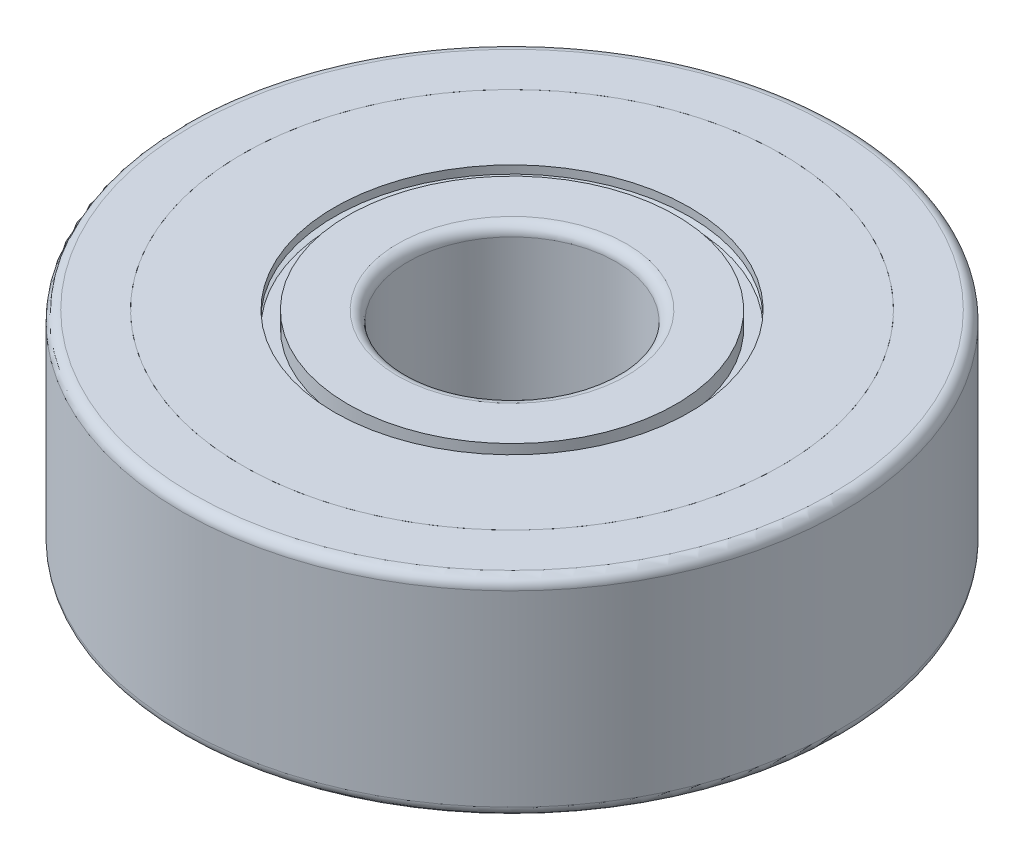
ISO-10303-21;
HEADER;
FILE_DESCRIPTION(('STEP AP214'),'2;1');
FILE_NAME('part.step','',(''),(''),'','','');
FILE_SCHEMA(('AUTOMOTIVE_DESIGN { 1 0 10303 214 1 1 1 1 }'));
ENDSEC;
DATA;
#1=APPLICATION_CONTEXT('core data for automotive mechanical design processes');
#2=APPLICATION_PROTOCOL_DEFINITION('international standard','automotive_design',2000,#1);
#3=PRODUCT_CONTEXT('',#1,'mechanical');
#4=PRODUCT('Part','Part','',(#3));
#5=PRODUCT_RELATED_PRODUCT_CATEGORY('part','',(#4));
#6=PRODUCT_DEFINITION_FORMATION('','',#4);
#7=PRODUCT_DEFINITION_CONTEXT('part definition',#1,'design');
#8=PRODUCT_DEFINITION('design','',#6,#7);
#9=PRODUCT_DEFINITION_SHAPE('','',#8);
#10=(LENGTH_UNIT() NAMED_UNIT(*) SI_UNIT(.MILLI.,.METRE.));
#11=(NAMED_UNIT(*) PLANE_ANGLE_UNIT() SI_UNIT($,.RADIAN.));
#12=(NAMED_UNIT(*) SI_UNIT($,.STERADIAN.) SOLID_ANGLE_UNIT());
#13=UNCERTAINTY_MEASURE_WITH_UNIT(LENGTH_MEASURE(1.E-05),#10,'distance_accuracy_value','');
#14=(GEOMETRIC_REPRESENTATION_CONTEXT(3) GLOBAL_UNCERTAINTY_ASSIGNED_CONTEXT((#13)) GLOBAL_UNIT_ASSIGNED_CONTEXT((#10,
#11,#12)) REPRESENTATION_CONTEXT('',''));
#15=CARTESIAN_POINT('',(0.,0.,0.));
#16=DIRECTION('',(0.,0.,1.));
#17=DIRECTION('',(1.,0.,0.));
#18=AXIS2_PLACEMENT_3D('',#15,#16,#17);
#19=CARTESIAN_POINT('',(0.,3.,0.));
#20=DIRECTION('',(0.,1.,0.));
#21=DIRECTION('',(0.,0.,-1.));
#22=AXIS2_PLACEMENT_3D('',#19,#20,#21);
#23=TOROIDAL_SURFACE('',#22,6.25,1.95);
#24=ADVANCED_FACE('P0_F14',(),#23,.T.);
#25=CLOSED_SHELL('',(#24));
#26=MANIFOLD_SOLID_BREP('P0_B1',#25);
#27=CARTESIAN_POINT('',(0.,6.,0.));
#28=DIRECTION('',(0.,-1.,0.));
#29=DIRECTION('',(0.,0.,-1.));
#30=AXIS2_PLACEMENT_3D('',#27,#28,#29);
#31=CYLINDRICAL_SURFACE('',#30,3.);
#32=CARTESIAN_POINT('',(0.,5.7,0.));
#33=DIRECTION('',(0.,1.,0.));
#34=DIRECTION('',(0.,0.,-1.));
#35=AXIS2_PLACEMENT_3D('',#32,#33,#34);
#36=CIRCLE('',#35,3.);
#37=CARTESIAN_POINT('',(0.,5.7,-3.));
#38=VERTEX_POINT('',#37);
#39=EDGE_CURVE('P1_E81',#38,#38,#36,.F.);
#40=ORIENTED_EDGE('',*,*,#39,.F.);
#41=EDGE_LOOP('',(#40));
#42=FACE_BOUND('',#41,.T.);
#43=CARTESIAN_POINT('',(0.,0.3,0.));
#44=DIRECTION('',(0.,-1.,0.));
#45=DIRECTION('',(0.,0.,1.));
#46=AXIS2_PLACEMENT_3D('',#43,#44,#45);
#47=CIRCLE('',#46,3.);
#48=CARTESIAN_POINT('',(0.,0.3,3.));
#49=VERTEX_POINT('',#48);
#50=EDGE_CURVE('P1_E77',#49,#49,#47,.F.);
#51=ORIENTED_EDGE('',*,*,#50,.F.);
#52=EDGE_LOOP('',(#51));
#53=FACE_BOUND('',#52,.T.);
#54=ADVANCED_FACE('P1_F15',(#42,#53),#31,.F.);
#55=CARTESIAN_POINT('',(0.,5.7,0.));
#56=DIRECTION('',(0.,1.,0.));
#57=DIRECTION('',(0.,0.,-1.));
#58=AXIS2_PLACEMENT_3D('',#55,#56,#57);
#59=TOROIDAL_SURFACE('',#58,3.3,0.3);
#60=CARTESIAN_POINT('',(0.,6.,0.));
#61=DIRECTION('',(0.,1.,0.));
#62=DIRECTION('',(0.,0.,1.));
#63=AXIS2_PLACEMENT_3D('',#60,#61,#62);
#64=CIRCLE('',#63,3.3);
#65=CARTESIAN_POINT('',(0.,6.,3.3));
#66=VERTEX_POINT('',#65);
#67=EDGE_CURVE('P1_E80',#66,#66,#64,.F.);
#68=ORIENTED_EDGE('',*,*,#67,.F.);
#69=EDGE_LOOP('',(#68));
#70=FACE_BOUND('',#69,.T.);
#71=ORIENTED_EDGE('',*,*,#39,.T.);
#72=EDGE_LOOP('',(#71));
#73=FACE_BOUND('',#72,.T.);
#74=ADVANCED_FACE('P1_F97',(#70,#73),#59,.T.);
#75=CARTESIAN_POINT('',(0.,0.3,0.));
#76=DIRECTION('',(0.,-1.,0.));
#77=DIRECTION('',(0.,0.,1.));
#78=AXIS2_PLACEMENT_3D('',#75,#76,#77);
#79=TOROIDAL_SURFACE('',#78,3.3,0.3);
#80=ORIENTED_EDGE('',*,*,#50,.T.);
#81=EDGE_LOOP('',(#80));
#82=FACE_BOUND('',#81,.T.);
#83=CARTESIAN_POINT('',(0.,0.,0.));
#84=DIRECTION('',(0.,-1.,0.));
#85=DIRECTION('',(0.,0.,-1.));
#86=AXIS2_PLACEMENT_3D('',#83,#84,#85);
#87=CIRCLE('',#86,3.3);
#88=CARTESIAN_POINT('',(0.,0.,-3.3));
#89=VERTEX_POINT('',#88);
#90=EDGE_CURVE('P1_E40',#89,#89,#87,.F.);
#91=ORIENTED_EDGE('',*,*,#90,.F.);
#92=EDGE_LOOP('',(#91));
#93=FACE_BOUND('',#92,.T.);
#94=ADVANCED_FACE('P1_F64',(#82,#93),#79,.T.);
#95=CARTESIAN_POINT('',(0.,6.,0.));
#96=DIRECTION('',(0.,1.,0.));
#97=DIRECTION('',(0.,0.,1.));
#98=AXIS2_PLACEMENT_3D('',#95,#96,#97);
#99=PLANE('',#98);
#100=CARTESIAN_POINT('',(0.,6.,0.));
#101=DIRECTION('',(0.,1.,0.));
#102=DIRECTION('',(0.,0.,1.));
#103=AXIS2_PLACEMENT_3D('',#100,#101,#102);
#104=CIRCLE('',#103,4.7225);
#105=CARTESIAN_POINT('',(0.,6.,4.7225));
#106=VERTEX_POINT('',#105);
#107=EDGE_CURVE('P1_E18',#106,#106,#104,.F.);
#108=ORIENTED_EDGE('',*,*,#107,.F.);
#109=EDGE_LOOP('',(#108));
#110=FACE_BOUND('',#109,.T.);
#111=ORIENTED_EDGE('',*,*,#67,.T.);
#112=EDGE_LOOP('',(#111));
#113=FACE_BOUND('',#112,.T.);
#114=ADVANCED_FACE('P1_F58',(#110,#113),#99,.T.);
#115=CARTESIAN_POINT('',(0.,0.,0.));
#116=DIRECTION('',(0.,-1.,0.));
#117=DIRECTION('',(0.,0.,-1.));
#118=AXIS2_PLACEMENT_3D('',#115,#116,#117);
#119=PLANE('',#118);
#120=CARTESIAN_POINT('',(0.,0.,0.));
#121=DIRECTION('',(0.,-1.,0.));
#122=DIRECTION('',(0.,0.,-1.));
#123=AXIS2_PLACEMENT_3D('',#120,#121,#122);
#124=CIRCLE('',#123,4.7225);
#125=CARTESIAN_POINT('',(0.,0.,-4.7225));
#126=VERTEX_POINT('',#125);
#127=EDGE_CURVE('P1_E122',#126,#126,#124,.F.);
#128=ORIENTED_EDGE('',*,*,#127,.F.);
#129=EDGE_LOOP('',(#128));
#130=FACE_BOUND('',#129,.T.);
#131=ORIENTED_EDGE('',*,*,#90,.T.);
#132=EDGE_LOOP('',(#131));
#133=FACE_BOUND('',#132,.T.);
#134=ADVANCED_FACE('P1_F47',(#130,#133),#119,.T.);
#135=CARTESIAN_POINT('',(0.,5.538,0.));
#136=DIRECTION('',(0.,1.,0.));
#137=DIRECTION('',(0.,0.,1.));
#138=AXIS2_PLACEMENT_3D('',#135,#136,#137);
#139=CYLINDRICAL_SURFACE('',#138,4.7225);
#140=CARTESIAN_POINT('',(0.,5.538,0.));
#141=DIRECTION('',(0.,1.,0.));
#142=DIRECTION('',(0.,0.,1.));
#143=AXIS2_PLACEMENT_3D('',#140,#141,#142);
#144=CIRCLE('',#143,4.7225);
#145=CARTESIAN_POINT('',(0.,5.538,4.7225));
#146=VERTEX_POINT('',#145);
#147=EDGE_CURVE('P1_E120',#146,#146,#144,.T.);
#148=ORIENTED_EDGE('',*,*,#147,.T.);
#149=EDGE_LOOP('',(#148));
#150=FACE_BOUND('',#149,.T.);
#151=ORIENTED_EDGE('',*,*,#107,.T.);
#152=EDGE_LOOP('',(#151));
#153=FACE_BOUND('',#152,.T.);
#154=ADVANCED_FACE('P1_F57',(#150,#153),#139,.T.);
#155=CARTESIAN_POINT('',(0.,0.462,0.));
#156=DIRECTION('',(0.,-1.,0.));
#157=DIRECTION('',(0.,0.,-1.));
#158=AXIS2_PLACEMENT_3D('',#155,#156,#157);
#159=CYLINDRICAL_SURFACE('',#158,4.7225);
#160=CARTESIAN_POINT('',(0.,0.462,0.));
#161=DIRECTION('',(0.,-1.,0.));
#162=DIRECTION('',(0.,0.,-1.));
#163=AXIS2_PLACEMENT_3D('',#160,#161,#162);
#164=CIRCLE('',#163,4.7225);
#165=CARTESIAN_POINT('',(0.,0.462,-4.7225));
#166=VERTEX_POINT('',#165);
#167=EDGE_CURVE('P1_E117',#166,#166,#164,.T.);
#168=ORIENTED_EDGE('',*,*,#167,.T.);
#169=EDGE_LOOP('',(#168));
#170=FACE_BOUND('',#169,.T.);
#171=ORIENTED_EDGE('',*,*,#127,.T.);
#172=EDGE_LOOP('',(#171));
#173=FACE_BOUND('',#172,.T.);
#174=ADVANCED_FACE('P1_F163',(#170,#173),#159,.T.);
#175=CARTESIAN_POINT('',(0.,5.538,0.));
#176=DIRECTION('',(0.,-1.,0.));
#177=DIRECTION('',(0.,0.,-1.));
#178=AXIS2_PLACEMENT_3D('',#175,#176,#177);
#179=PLANE('',#178);
#180=ORIENTED_EDGE('',*,*,#147,.F.);
#181=EDGE_LOOP('',(#180));
#182=FACE_BOUND('',#181,.T.);
#183=CARTESIAN_POINT('',(0.,5.538,0.));
#184=DIRECTION('',(0.,1.,0.));
#185=DIRECTION('',(0.,0.,1.));
#186=AXIS2_PLACEMENT_3D('',#183,#184,#185);
#187=CIRCLE('',#186,5.119);
#188=CARTESIAN_POINT('',(0.,5.538,5.119));
#189=VERTEX_POINT('',#188);
#190=EDGE_CURVE('P1_E114',#189,#189,#187,.F.);
#191=ORIENTED_EDGE('',*,*,#190,.F.);
#192=EDGE_LOOP('',(#191));
#193=FACE_BOUND('',#192,.T.);
#194=ADVANCED_FACE('P1_F160',(#182,#193),#179,.F.);
#195=CARTESIAN_POINT('',(0.,0.462,0.));
#196=DIRECTION('',(0.,1.,0.));
#197=DIRECTION('',(0.,0.,1.));
#198=AXIS2_PLACEMENT_3D('',#195,#196,#197);
#199=PLANE('',#198);
#200=ORIENTED_EDGE('',*,*,#167,.F.);
#201=EDGE_LOOP('',(#200));
#202=FACE_BOUND('',#201,.T.);
#203=CARTESIAN_POINT('',(0.,0.462,0.));
#204=DIRECTION('',(0.,1.,0.));
#205=DIRECTION('',(0.,0.,1.));
#206=AXIS2_PLACEMENT_3D('',#203,#204,#205);
#207=CIRCLE('',#206,5.119);
#208=CARTESIAN_POINT('',(0.,0.462,5.119));
#209=VERTEX_POINT('',#208);
#210=EDGE_CURVE('P1_E27',#209,#209,#207,.T.);
#211=ORIENTED_EDGE('',*,*,#210,.F.);
#212=EDGE_LOOP('',(#211));
#213=FACE_BOUND('',#212,.T.);
#214=ADVANCED_FACE('P1_F156',(#202,#213),#199,.F.);
#215=CARTESIAN_POINT('',(0.,0.,0.));
#216=DIRECTION('',(0.,1.,0.));
#217=DIRECTION('',(0.,0.,1.));
#218=AXIS2_PLACEMENT_3D('',#215,#216,#217);
#219=CYLINDRICAL_SURFACE('',#218,5.119);
#220=CARTESIAN_POINT('',(0.,4.58850212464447,0.));
#221=DIRECTION('',(0.,1.,0.));
#222=DIRECTION('',(0.,0.,-1.));
#223=AXIS2_PLACEMENT_3D('',#220,#221,#222);
#224=CIRCLE('',#223,5.119);
#225=CARTESIAN_POINT('',(0.,4.58850212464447,-5.119));
#226=VERTEX_POINT('',#225);
#227=EDGE_CURVE('P1_E22',#226,#226,#224,.T.);
#228=ORIENTED_EDGE('',*,*,#227,.T.);
#229=EDGE_LOOP('',(#228));
#230=FACE_BOUND('',#229,.T.);
#231=ORIENTED_EDGE('',*,*,#190,.T.);
#232=EDGE_LOOP('',(#231));
#233=FACE_BOUND('',#232,.T.);
#234=ADVANCED_FACE('P1_F150',(#230,#233),#219,.T.);
#235=CARTESIAN_POINT('',(0.,0.,0.));
#236=DIRECTION('',(0.,1.,0.));
#237=DIRECTION('',(0.,0.,1.));
#238=AXIS2_PLACEMENT_3D('',#235,#236,#237);
#239=CYLINDRICAL_SURFACE('',#238,5.119);
#240=CARTESIAN_POINT('',(0.,1.41149787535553,0.));
#241=DIRECTION('',(0.,1.,0.));
#242=DIRECTION('',(0.,0.,-1.));
#243=AXIS2_PLACEMENT_3D('',#240,#241,#242);
#244=CIRCLE('',#243,5.119);
#245=CARTESIAN_POINT('',(0.,1.41149787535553,-5.119));
#246=VERTEX_POINT('',#245);
#247=EDGE_CURVE('P1_E10',#246,#246,#244,.F.);
#248=ORIENTED_EDGE('',*,*,#247,.T.);
#249=EDGE_LOOP('',(#248));
#250=FACE_BOUND('',#249,.T.);
#251=ORIENTED_EDGE('',*,*,#210,.T.);
#252=EDGE_LOOP('',(#251));
#253=FACE_BOUND('',#252,.T.);
#254=ADVANCED_FACE('P1_F144',(#250,#253),#239,.T.);
#255=CARTESIAN_POINT('',(0.,3.,0.));
#256=DIRECTION('',(0.,1.,0.));
#257=DIRECTION('',(0.,0.,-1.));
#258=AXIS2_PLACEMENT_3D('',#255,#256,#257);
#259=TOROIDAL_SURFACE('',#258,6.25,1.95);
#260=ORIENTED_EDGE('',*,*,#247,.F.);
#261=EDGE_LOOP('',(#260));
#262=FACE_BOUND('',#261,.T.);
#263=ORIENTED_EDGE('',*,*,#227,.F.);
#264=EDGE_LOOP('',(#263));
#265=FACE_BOUND('',#264,.T.);
#266=ADVANCED_FACE('P1_F142',(#262,#265),#259,.F.);
#267=CLOSED_SHELL('',(#54,#74,#94,#114,#134,#154,#174,#194,#214,#234,#254,#266));
#268=MANIFOLD_SOLID_BREP('P1_B1',#267);
#269=CARTESIAN_POINT('',(0.,6.,0.));
#270=DIRECTION('',(0.,1.,0.));
#271=DIRECTION('',(0.,0.,1.));
#272=AXIS2_PLACEMENT_3D('',#269,#270,#271);
#273=PLANE('',#272);
#274=CARTESIAN_POINT('',(0.,6.,0.));
#275=DIRECTION('',(0.,1.,0.));
#276=DIRECTION('',(0.,0.,1.));
#277=AXIS2_PLACEMENT_3D('',#274,#275,#276);
#278=CIRCLE('',#277,7.7775);
#279=CARTESIAN_POINT('',(0.,6.,7.7775));
#280=VERTEX_POINT('',#279);
#281=EDGE_CURVE('P2_E27',#280,#280,#278,.F.);
#282=ORIENTED_EDGE('',*,*,#281,.F.);
#283=EDGE_LOOP('',(#282));
#284=FACE_BOUND('',#283,.T.);
#285=CARTESIAN_POINT('',(0.,6.,0.));
#286=DIRECTION('',(0.,-1.,0.));
#287=DIRECTION('',(0.,0.,-1.));
#288=AXIS2_PLACEMENT_3D('',#285,#286,#287);
#289=CIRCLE('',#288,5.119);
#290=CARTESIAN_POINT('',(0.,6.,-5.119));
#291=VERTEX_POINT('',#290);
#292=EDGE_CURVE('P2_E18',#291,#291,#289,.T.);
#293=ORIENTED_EDGE('',*,*,#292,.T.);
#294=EDGE_LOOP('',(#293));
#295=FACE_BOUND('',#294,.T.);
#296=ADVANCED_FACE('P2_F15',(#284,#295),#273,.T.);
#297=CARTESIAN_POINT('',(0.,6.,0.));
#298=DIRECTION('',(0.,-1.,0.));
#299=DIRECTION('',(0.,0.,-1.));
#300=AXIS2_PLACEMENT_3D('',#297,#298,#299);
#301=CYLINDRICAL_SURFACE('',#300,5.119);
#302=CARTESIAN_POINT('',(0.,5.769,0.));
#303=DIRECTION('',(0.,-1.,0.));
#304=DIRECTION('',(0.,0.,-1.));
#305=AXIS2_PLACEMENT_3D('',#302,#303,#304);
#306=CIRCLE('',#305,5.119);
#307=CARTESIAN_POINT('',(0.,5.769,-5.119));
#308=VERTEX_POINT('',#307);
#309=EDGE_CURVE('P2_E22',#308,#308,#306,.T.);
#310=ORIENTED_EDGE('',*,*,#309,.T.);
#311=EDGE_LOOP('',(#310));
#312=FACE_BOUND('',#311,.T.);
#313=ORIENTED_EDGE('',*,*,#292,.F.);
#314=EDGE_LOOP('',(#313));
#315=FACE_BOUND('',#314,.T.);
#316=ADVANCED_FACE('P2_F36',(#312,#315),#301,.F.);
#317=CARTESIAN_POINT('',(0.,0.,0.));
#318=DIRECTION('',(0.,1.,0.));
#319=DIRECTION('',(0.,0.,1.));
#320=AXIS2_PLACEMENT_3D('',#317,#318,#319);
#321=CYLINDRICAL_SURFACE('',#320,7.7775);
#322=ORIENTED_EDGE('',*,*,#281,.T.);
#323=EDGE_LOOP('',(#322));
#324=FACE_BOUND('',#323,.T.);
#325=CARTESIAN_POINT('',(0.,5.769,0.));
#326=DIRECTION('',(0.,1.,0.));
#327=DIRECTION('',(0.,0.,1.));
#328=AXIS2_PLACEMENT_3D('',#325,#326,#327);
#329=CIRCLE('',#328,7.7775);
#330=CARTESIAN_POINT('',(0.,5.769,7.7775));
#331=VERTEX_POINT('',#330);
#332=EDGE_CURVE('P2_E10',#331,#331,#329,.T.);
#333=ORIENTED_EDGE('',*,*,#332,.T.);
#334=EDGE_LOOP('',(#333));
#335=FACE_BOUND('',#334,.T.);
#336=ADVANCED_FACE('P2_F38',(#324,#335),#321,.T.);
#337=CARTESIAN_POINT('',(0.,5.769,0.));
#338=DIRECTION('',(0.,1.,0.));
#339=DIRECTION('',(0.,0.,1.));
#340=AXIS2_PLACEMENT_3D('',#337,#338,#339);
#341=PLANE('',#340);
#342=ORIENTED_EDGE('',*,*,#332,.F.);
#343=EDGE_LOOP('',(#342));
#344=FACE_BOUND('',#343,.T.);
#345=ORIENTED_EDGE('',*,*,#309,.F.);
#346=EDGE_LOOP('',(#345));
#347=FACE_BOUND('',#346,.T.);
#348=ADVANCED_FACE('P2_F45',(#344,#347),#341,.F.);
#349=CLOSED_SHELL('',(#296,#316,#336,#348));
#350=MANIFOLD_SOLID_BREP('P2_B1',#349);
#351=CARTESIAN_POINT('',(0.,3.,0.));
#352=DIRECTION('',(0.,1.,0.));
#353=DIRECTION('',(0.,0.,-1.));
#354=AXIS2_PLACEMENT_3D('',#351,#352,#353);
#355=TOROIDAL_SURFACE('',#354,6.25,1.95);
#356=CARTESIAN_POINT('',(0.,4.58850212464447,0.));
#357=DIRECTION('',(0.,-1.,0.));
#358=DIRECTION('',(0.,0.,-1.));
#359=AXIS2_PLACEMENT_3D('',#356,#357,#358);
#360=CIRCLE('',#359,7.381);
#361=CARTESIAN_POINT('',(0.,4.58850212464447,-7.381));
#362=VERTEX_POINT('',#361);
#363=EDGE_CURVE('P3_E141',#362,#362,#360,.F.);
#364=ORIENTED_EDGE('',*,*,#363,.T.);
#365=EDGE_LOOP('',(#364));
#366=FACE_BOUND('',#365,.T.);
#367=CARTESIAN_POINT('',(0.,1.41149787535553,0.));
#368=DIRECTION('',(0.,-1.,0.));
#369=DIRECTION('',(0.,0.,-1.));
#370=AXIS2_PLACEMENT_3D('',#367,#368,#369);
#371=CIRCLE('',#370,7.381);
#372=CARTESIAN_POINT('',(0.,1.41149787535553,-7.381));
#373=VERTEX_POINT('',#372);
#374=EDGE_CURVE('P3_E144',#373,#373,#371,.T.);
#375=ORIENTED_EDGE('',*,*,#374,.T.);
#376=EDGE_LOOP('',(#375));
#377=FACE_BOUND('',#376,.T.);
#378=ADVANCED_FACE('P3_F15',(#366,#377),#355,.F.);
#379=CARTESIAN_POINT('',(0.,6.,0.));
#380=DIRECTION('',(0.,-1.,0.));
#381=DIRECTION('',(0.,0.,-1.));
#382=AXIS2_PLACEMENT_3D('',#379,#380,#381);
#383=CYLINDRICAL_SURFACE('',#382,7.381);
#384=ORIENTED_EDGE('',*,*,#374,.F.);
#385=EDGE_LOOP('',(#384));
#386=FACE_BOUND('',#385,.T.);
#387=CARTESIAN_POINT('',(0.,0.462,0.));
#388=DIRECTION('',(0.,-1.,0.));
#389=DIRECTION('',(0.,0.,-1.));
#390=AXIS2_PLACEMENT_3D('',#387,#388,#389);
#391=CIRCLE('',#390,7.381);
#392=CARTESIAN_POINT('',(0.,0.462,-7.381));
#393=VERTEX_POINT('',#392);
#394=EDGE_CURVE('P3_E19',#393,#393,#391,.T.);
#395=ORIENTED_EDGE('',*,*,#394,.T.);
#396=EDGE_LOOP('',(#395));
#397=FACE_BOUND('',#396,.T.);
#398=ADVANCED_FACE('P3_F101',(#386,#397),#383,.F.);
#399=CARTESIAN_POINT('',(0.,6.,0.));
#400=DIRECTION('',(0.,-1.,0.));
#401=DIRECTION('',(0.,0.,-1.));
#402=AXIS2_PLACEMENT_3D('',#399,#400,#401);
#403=CYLINDRICAL_SURFACE('',#402,7.381);
#404=ORIENTED_EDGE('',*,*,#363,.F.);
#405=EDGE_LOOP('',(#404));
#406=FACE_BOUND('',#405,.T.);
#407=CARTESIAN_POINT('',(0.,5.538,0.));
#408=DIRECTION('',(0.,-1.,0.));
#409=DIRECTION('',(0.,0.,-1.));
#410=AXIS2_PLACEMENT_3D('',#407,#408,#409);
#411=CIRCLE('',#410,7.381);
#412=CARTESIAN_POINT('',(0.,5.538,-7.381));
#413=VERTEX_POINT('',#412);
#414=EDGE_CURVE('P3_E136',#413,#413,#411,.F.);
#415=ORIENTED_EDGE('',*,*,#414,.T.);
#416=EDGE_LOOP('',(#415));
#417=FACE_BOUND('',#416,.T.);
#418=ADVANCED_FACE('P3_F98',(#406,#417),#403,.F.);
#419=CARTESIAN_POINT('',(0.,0.462,0.));
#420=DIRECTION('',(0.,1.,0.));
#421=DIRECTION('',(0.,0.,1.));
#422=AXIS2_PLACEMENT_3D('',#419,#420,#421);
#423=PLANE('',#422);
#424=ORIENTED_EDGE('',*,*,#394,.F.);
#425=EDGE_LOOP('',(#424));
#426=FACE_BOUND('',#425,.T.);
#427=CARTESIAN_POINT('',(0.,0.462,0.));
#428=DIRECTION('',(0.,1.,0.));
#429=DIRECTION('',(0.,0.,1.));
#430=AXIS2_PLACEMENT_3D('',#427,#428,#429);
#431=CIRCLE('',#430,7.7775);
#432=CARTESIAN_POINT('',(0.,0.462,7.7775));
#433=VERTEX_POINT('',#432);
#434=EDGE_CURVE('P3_E134',#433,#433,#431,.F.);
#435=ORIENTED_EDGE('',*,*,#434,.T.);
#436=EDGE_LOOP('',(#435));
#437=FACE_BOUND('',#436,.T.);
#438=ADVANCED_FACE('P3_F94',(#426,#437),#423,.F.);
#439=CARTESIAN_POINT('',(0.,5.538,0.));
#440=DIRECTION('',(0.,-1.,0.));
#441=DIRECTION('',(0.,0.,-1.));
#442=AXIS2_PLACEMENT_3D('',#439,#440,#441);
#443=PLANE('',#442);
#444=ORIENTED_EDGE('',*,*,#414,.F.);
#445=EDGE_LOOP('',(#444));
#446=FACE_BOUND('',#445,.T.);
#447=CARTESIAN_POINT('',(0.,5.538,0.));
#448=DIRECTION('',(0.,-1.,0.));
#449=DIRECTION('',(0.,0.,-1.));
#450=AXIS2_PLACEMENT_3D('',#447,#448,#449);
#451=CIRCLE('',#450,7.7775);
#452=CARTESIAN_POINT('',(0.,5.538,-7.7775));
#453=VERTEX_POINT('',#452);
#454=EDGE_CURVE('P3_E127',#453,#453,#451,.F.);
#455=ORIENTED_EDGE('',*,*,#454,.T.);
#456=EDGE_LOOP('',(#455));
#457=FACE_BOUND('',#456,.T.);
#458=ADVANCED_FACE('P3_F90',(#446,#457),#443,.F.);
#459=CARTESIAN_POINT('',(0.,0.,0.));
#460=DIRECTION('',(0.,1.,0.));
#461=DIRECTION('',(0.,0.,1.));
#462=AXIS2_PLACEMENT_3D('',#459,#460,#461);
#463=CYLINDRICAL_SURFACE('',#462,7.7775);
#464=CARTESIAN_POINT('',(0.,0.,0.));
#465=DIRECTION('',(0.,1.,0.));
#466=DIRECTION('',(0.,0.,1.));
#467=AXIS2_PLACEMENT_3D('',#464,#465,#466);
#468=CIRCLE('',#467,7.7775);
#469=CARTESIAN_POINT('',(0.,0.,7.7775));
#470=VERTEX_POINT('',#469);
#471=EDGE_CURVE('P3_E122',#470,#470,#468,.T.);
#472=ORIENTED_EDGE('',*,*,#471,.F.);
#473=EDGE_LOOP('',(#472));
#474=FACE_BOUND('',#473,.T.);
#475=ORIENTED_EDGE('',*,*,#434,.F.);
#476=EDGE_LOOP('',(#475));
#477=FACE_BOUND('',#476,.T.);
#478=ADVANCED_FACE('P3_F86',(#474,#477),#463,.F.);
#479=CARTESIAN_POINT('',(0.,6.,0.));
#480=DIRECTION('',(0.,-1.,0.));
#481=DIRECTION('',(0.,0.,-1.));
#482=AXIS2_PLACEMENT_3D('',#479,#480,#481);
#483=CYLINDRICAL_SURFACE('',#482,7.7775);
#484=CARTESIAN_POINT('',(0.,6.,0.));
#485=DIRECTION('',(0.,-1.,0.));
#486=DIRECTION('',(0.,0.,-1.));
#487=AXIS2_PLACEMENT_3D('',#484,#485,#486);
#488=CIRCLE('',#487,7.7775);
#489=CARTESIAN_POINT('',(0.,6.,-7.7775));
#490=VERTEX_POINT('',#489);
#491=EDGE_CURVE('P3_E120',#490,#490,#488,.T.);
#492=ORIENTED_EDGE('',*,*,#491,.F.);
#493=EDGE_LOOP('',(#492));
#494=FACE_BOUND('',#493,.T.);
#495=ORIENTED_EDGE('',*,*,#454,.F.);
#496=EDGE_LOOP('',(#495));
#497=FACE_BOUND('',#496,.T.);
#498=ADVANCED_FACE('P3_F82',(#494,#497),#483,.F.);
#499=CARTESIAN_POINT('',(0.,0.,0.));
#500=DIRECTION('',(0.,-1.,0.));
#501=DIRECTION('',(0.,0.,-1.));
#502=AXIS2_PLACEMENT_3D('',#499,#500,#501);
#503=PLANE('',#502);
#504=CARTESIAN_POINT('',(0.,0.,0.));
#505=DIRECTION('',(0.,1.,0.));
#506=DIRECTION('',(0.,0.,-1.));
#507=AXIS2_PLACEMENT_3D('',#504,#505,#506);
#508=CIRCLE('',#507,9.2);
#509=CARTESIAN_POINT('',(0.,0.,-9.2));
#510=VERTEX_POINT('',#509);
#511=EDGE_CURVE('P3_E66',#510,#510,#508,.T.);
#512=ORIENTED_EDGE('',*,*,#511,.F.);
#513=EDGE_LOOP('',(#512));
#514=FACE_BOUND('',#513,.T.);
#515=ORIENTED_EDGE('',*,*,#471,.T.);
#516=EDGE_LOOP('',(#515));
#517=FACE_BOUND('',#516,.T.);
#518=ADVANCED_FACE('P3_F72',(#514,#517),#503,.T.);
#519=CARTESIAN_POINT('',(0.,6.,0.));
#520=DIRECTION('',(0.,1.,0.));
#521=DIRECTION('',(0.,0.,1.));
#522=AXIS2_PLACEMENT_3D('',#519,#520,#521);
#523=PLANE('',#522);
#524=CARTESIAN_POINT('',(0.,6.,0.));
#525=DIRECTION('',(0.,-1.,0.));
#526=DIRECTION('',(0.,0.,1.));
#527=AXIS2_PLACEMENT_3D('',#524,#525,#526);
#528=CIRCLE('',#527,9.2);
#529=CARTESIAN_POINT('',(0.,6.,9.2));
#530=VERTEX_POINT('',#529);
#531=EDGE_CURVE('P3_E28',#530,#530,#528,.T.);
#532=ORIENTED_EDGE('',*,*,#531,.F.);
#533=EDGE_LOOP('',(#532));
#534=FACE_BOUND('',#533,.T.);
#535=ORIENTED_EDGE('',*,*,#491,.T.);
#536=EDGE_LOOP('',(#535));
#537=FACE_BOUND('',#536,.T.);
#538=ADVANCED_FACE('P3_F81',(#534,#537),#523,.T.);
#539=CARTESIAN_POINT('',(0.,0.3,0.));
#540=DIRECTION('',(0.,-1.,0.));
#541=DIRECTION('',(0.,0.,1.));
#542=AXIS2_PLACEMENT_3D('',#539,#540,#541);
#543=TOROIDAL_SURFACE('',#542,9.2,0.3);
#544=CARTESIAN_POINT('',(0.,0.3,0.));
#545=DIRECTION('',(0.,1.,0.));
#546=DIRECTION('',(0.,0.,1.));
#547=AXIS2_PLACEMENT_3D('',#544,#545,#546);
#548=CIRCLE('',#547,9.5);
#549=CARTESIAN_POINT('',(0.,0.3,9.5));
#550=VERTEX_POINT('',#549);
#551=EDGE_CURVE('P3_E23',#550,#550,#548,.T.);
#552=ORIENTED_EDGE('',*,*,#551,.F.);
#553=EDGE_LOOP('',(#552));
#554=FACE_BOUND('',#553,.T.);
#555=ORIENTED_EDGE('',*,*,#511,.T.);
#556=EDGE_LOOP('',(#555));
#557=FACE_BOUND('',#556,.T.);
#558=ADVANCED_FACE('P3_F46',(#554,#557),#543,.T.);
#559=CARTESIAN_POINT('',(0.,5.7,0.));
#560=DIRECTION('',(0.,1.,0.));
#561=DIRECTION('',(0.,0.,-1.));
#562=AXIS2_PLACEMENT_3D('',#559,#560,#561);
#563=TOROIDAL_SURFACE('',#562,9.2,0.3);
#564=CARTESIAN_POINT('',(0.,5.7,0.));
#565=DIRECTION('',(0.,1.,0.));
#566=DIRECTION('',(0.,0.,1.));
#567=AXIS2_PLACEMENT_3D('',#564,#565,#566);
#568=CIRCLE('',#567,9.5);
#569=CARTESIAN_POINT('',(0.,5.7,9.5));
#570=VERTEX_POINT('',#569);
#571=EDGE_CURVE('P3_E10',#570,#570,#568,.F.);
#572=ORIENTED_EDGE('',*,*,#571,.F.);
#573=EDGE_LOOP('',(#572));
#574=FACE_BOUND('',#573,.T.);
#575=ORIENTED_EDGE('',*,*,#531,.T.);
#576=EDGE_LOOP('',(#575));
#577=FACE_BOUND('',#576,.T.);
#578=ADVANCED_FACE('P3_F40',(#574,#577),#563,.T.);
#579=CARTESIAN_POINT('',(0.,0.,0.));
#580=DIRECTION('',(0.,1.,0.));
#581=DIRECTION('',(0.,0.,1.));
#582=AXIS2_PLACEMENT_3D('',#579,#580,#581);
#583=CYLINDRICAL_SURFACE('',#582,9.5);
#584=ORIENTED_EDGE('',*,*,#571,.T.);
#585=EDGE_LOOP('',(#584));
#586=FACE_BOUND('',#585,.T.);
#587=ORIENTED_EDGE('',*,*,#551,.T.);
#588=EDGE_LOOP('',(#587));
#589=FACE_BOUND('',#588,.T.);
#590=ADVANCED_FACE('P3_F45',(#586,#589),#583,.T.);
#591=CLOSED_SHELL('',(#378,#398,#418,#438,#458,#478,#498,#518,#538,#558,#578,#590));
#592=MANIFOLD_SOLID_BREP('P3_B1',#591);
#593=CARTESIAN_POINT('',(0.,0.,0.));
#594=DIRECTION('',(0.,-1.,0.));
#595=DIRECTION('',(0.,0.,-1.));
#596=AXIS2_PLACEMENT_3D('',#593,#594,#595);
#597=PLANE('',#596);
#598=CARTESIAN_POINT('',(0.,0.,0.));
#599=DIRECTION('',(0.,1.,0.));
#600=DIRECTION('',(0.,0.,1.));
#601=AXIS2_PLACEMENT_3D('',#598,#599,#600);
#602=CIRCLE('',#601,7.7775);
#603=CARTESIAN_POINT('',(0.,0.,7.7775));
#604=VERTEX_POINT('',#603);
#605=EDGE_CURVE('P4_E27',#604,#604,#602,.T.);
#606=ORIENTED_EDGE('',*,*,#605,.F.);
#607=EDGE_LOOP('',(#606));
#608=FACE_BOUND('',#607,.T.);
#609=CARTESIAN_POINT('',(0.,0.,0.));
#610=DIRECTION('',(0.,-1.,0.));
#611=DIRECTION('',(0.,0.,-1.));
#612=AXIS2_PLACEMENT_3D('',#609,#610,#611);
#613=CIRCLE('',#612,5.119);
#614=CARTESIAN_POINT('',(0.,0.,-5.119));
#615=VERTEX_POINT('',#614);
#616=EDGE_CURVE('P4_E18',#615,#615,#613,.F.);
#617=ORIENTED_EDGE('',*,*,#616,.T.);
#618=EDGE_LOOP('',(#617));
#619=FACE_BOUND('',#618,.T.);
#620=ADVANCED_FACE('P4_F15',(#608,#619),#597,.T.);
#621=CARTESIAN_POINT('',(0.,0.231,0.));
#622=DIRECTION('',(0.,-1.,0.));
#623=DIRECTION('',(0.,0.,-1.));
#624=AXIS2_PLACEMENT_3D('',#621,#622,#623);
#625=CYLINDRICAL_SURFACE('',#624,5.119);
#626=CARTESIAN_POINT('',(0.,0.231,0.));
#627=DIRECTION('',(0.,-1.,0.));
#628=DIRECTION('',(0.,0.,-1.));
#629=AXIS2_PLACEMENT_3D('',#626,#627,#628);
#630=CIRCLE('',#629,5.119);
#631=CARTESIAN_POINT('',(0.,0.231,-5.119));
#632=VERTEX_POINT('',#631);
#633=EDGE_CURVE('P4_E22',#632,#632,#630,.T.);
#634=ORIENTED_EDGE('',*,*,#633,.F.);
#635=EDGE_LOOP('',(#634));
#636=FACE_BOUND('',#635,.T.);
#637=ORIENTED_EDGE('',*,*,#616,.F.);
#638=EDGE_LOOP('',(#637));
#639=FACE_BOUND('',#638,.T.);
#640=ADVANCED_FACE('P4_F36',(#636,#639),#625,.F.);
#641=CARTESIAN_POINT('',(0.,0.,0.));
#642=DIRECTION('',(0.,1.,0.));
#643=DIRECTION('',(0.,0.,1.));
#644=AXIS2_PLACEMENT_3D('',#641,#642,#643);
#645=CYLINDRICAL_SURFACE('',#644,7.7775);
#646=ORIENTED_EDGE('',*,*,#605,.T.);
#647=EDGE_LOOP('',(#646));
#648=FACE_BOUND('',#647,.T.);
#649=CARTESIAN_POINT('',(0.,0.231,0.));
#650=DIRECTION('',(0.,1.,0.));
#651=DIRECTION('',(0.,0.,1.));
#652=AXIS2_PLACEMENT_3D('',#649,#650,#651);
#653=CIRCLE('',#652,7.7775);
#654=CARTESIAN_POINT('',(0.,0.231,7.7775));
#655=VERTEX_POINT('',#654);
#656=EDGE_CURVE('P4_E10',#655,#655,#653,.T.);
#657=ORIENTED_EDGE('',*,*,#656,.F.);
#658=EDGE_LOOP('',(#657));
#659=FACE_BOUND('',#658,.T.);
#660=ADVANCED_FACE('P4_F38',(#648,#659),#645,.T.);
#661=CARTESIAN_POINT('',(0.,0.231,0.));
#662=DIRECTION('',(0.,1.,0.));
#663=DIRECTION('',(0.,0.,1.));
#664=AXIS2_PLACEMENT_3D('',#661,#662,#663);
#665=PLANE('',#664);
#666=ORIENTED_EDGE('',*,*,#656,.T.);
#667=EDGE_LOOP('',(#666));
#668=FACE_BOUND('',#667,.T.);
#669=ORIENTED_EDGE('',*,*,#633,.T.);
#670=EDGE_LOOP('',(#669));
#671=FACE_BOUND('',#670,.T.);
#672=ADVANCED_FACE('P4_F45',(#668,#671),#665,.T.);
#673=CLOSED_SHELL('',(#620,#640,#660,#672));
#674=MANIFOLD_SOLID_BREP('P4_B1',#673);
#675=ADVANCED_BREP_SHAPE_REPRESENTATION('',(#18,#26,#268,#350,#592,#674),#14);
#676=SHAPE_DEFINITION_REPRESENTATION(#9,#675);
ENDSEC;
END-ISO-10303-21;
